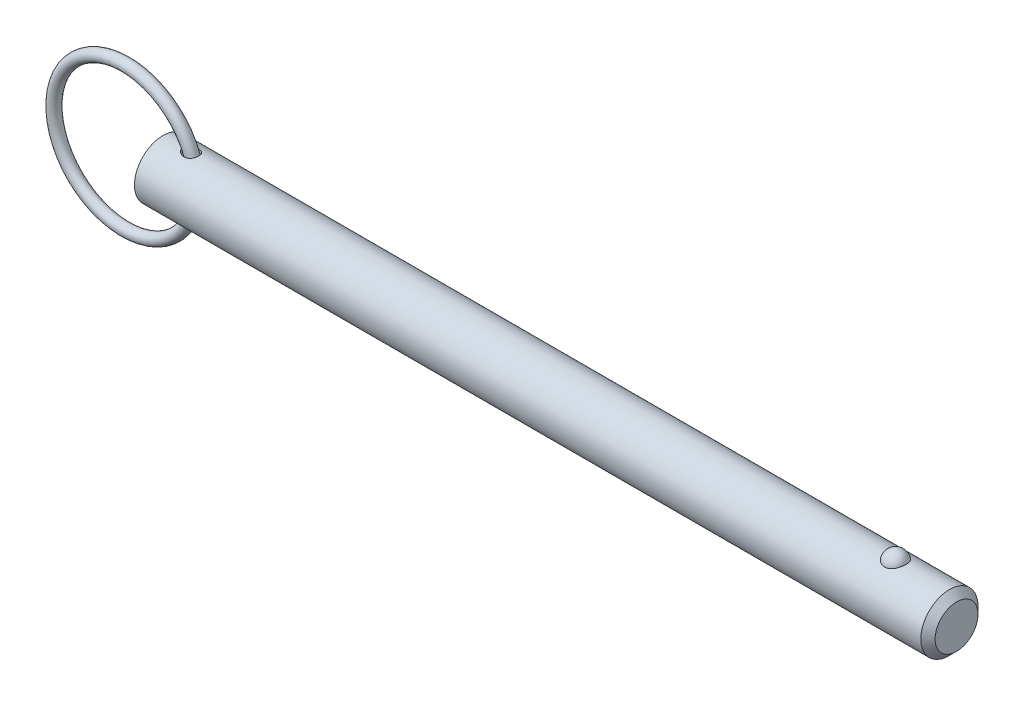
ISO-10303-21;
HEADER;
FILE_DESCRIPTION(('STEP AP214'),'2;1');
FILE_NAME('part.step','',(''),(''),'','','');
FILE_SCHEMA(('AUTOMOTIVE_DESIGN { 1 0 10303 214 1 1 1 1 }'));
ENDSEC;
DATA;
#1=APPLICATION_CONTEXT('core data for automotive mechanical design processes');
#2=APPLICATION_PROTOCOL_DEFINITION('international standard','automotive_design',2000,#1);
#3=PRODUCT_CONTEXT('',#1,'mechanical');
#4=PRODUCT('Part','Part','',(#3));
#5=PRODUCT_RELATED_PRODUCT_CATEGORY('part','',(#4));
#6=PRODUCT_DEFINITION_FORMATION('','',#4);
#7=PRODUCT_DEFINITION_CONTEXT('part definition',#1,'design');
#8=PRODUCT_DEFINITION('design','',#6,#7);
#9=PRODUCT_DEFINITION_SHAPE('','',#8);
#10=(LENGTH_UNIT() NAMED_UNIT(*) SI_UNIT(.MILLI.,.METRE.));
#11=(NAMED_UNIT(*) PLANE_ANGLE_UNIT() SI_UNIT($,.RADIAN.));
#12=(NAMED_UNIT(*) SI_UNIT($,.STERADIAN.) SOLID_ANGLE_UNIT());
#13=UNCERTAINTY_MEASURE_WITH_UNIT(LENGTH_MEASURE(1.E-05),#10,'distance_accuracy_value','');
#14=(GEOMETRIC_REPRESENTATION_CONTEXT(3) GLOBAL_UNCERTAINTY_ASSIGNED_CONTEXT((#13)) GLOBAL_UNIT_ASSIGNED_CONTEXT((#10,
#11,#12)) REPRESENTATION_CONTEXT('',''));
#15=CARTESIAN_POINT('',(0.,0.,0.));
#16=DIRECTION('',(0.,0.,1.));
#17=DIRECTION('',(1.,0.,0.));
#18=AXIS2_PLACEMENT_3D('',#15,#16,#17);
#19=CARTESIAN_POINT('',(-8.34703434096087,0.,0.));
#20=DIRECTION('',(0.,0.,1.));
#21=DIRECTION('',(1.,0.,0.));
#22=AXIS2_PLACEMENT_3D('',#19,#20,#21);
#23=TOROIDAL_SURFACE('',#22,15.875,1.27);
#24=CARTESIAN_POINT('',(8.79796565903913,0.,0.));
#25=VERTEX_POINT('',#24);
#26=VERTEX_LOOP('',#25);
#27=FACE_BOUND('',#26,.T.);
#28=ADVANCED_FACE('P0_F12',(#27),#23,.T.);
#29=CLOSED_SHELL('',(#28));
#30=MANIFOLD_SOLID_BREP('P0_B1',#29);
#31=CARTESIAN_POINT('',(0.,0.,0.));
#32=DIRECTION('',(1.,0.,0.));
#33=DIRECTION('',(0.,0.,-1.));
#34=AXIS2_PLACEMENT_3D('',#31,#32,#33);
#35=CYLINDRICAL_SURFACE('',#34,6.35);
#36=CARTESIAN_POINT('',(4.87230670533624,6.27273159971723,-0.987592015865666));
#37=CARTESIAN_POINT('',(4.94734735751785,6.26035058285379,-1.06623378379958));
#38=CARTESIAN_POINT('',(5.02968768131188,6.24755813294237,-1.13788608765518));
#39=CARTESIAN_POINT('',(5.20534267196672,6.22278258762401,-1.26640223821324));
#40=CARTESIAN_POINT('',(5.29867273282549,6.21080066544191,-1.32324497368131));
#41=CARTESIAN_POINT('',(5.49318962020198,6.18912414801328,-1.42117930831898));
#42=CARTESIAN_POINT('',(5.59435470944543,6.17942350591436,-1.46231273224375));
#43=CARTESIAN_POINT('',(5.80219659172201,6.16352555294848,-1.52793951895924));
#44=CARTESIAN_POINT('',(5.90887152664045,6.15732706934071,-1.55243845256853));
#45=CARTESIAN_POINT('',(6.12818220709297,6.14931784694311,-1.58387975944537));
#46=CARTESIAN_POINT('',(6.24090110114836,6.14763959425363,-1.59029227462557));
#47=CARTESIAN_POINT('',(6.46560233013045,6.14965588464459,-1.58248630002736));
#48=CARTESIAN_POINT('',(6.57758514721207,6.15334646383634,-1.56828303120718));
#49=CARTESIAN_POINT('',(6.78516594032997,6.1652116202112,-1.52091398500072));
#50=CARTESIAN_POINT('',(6.88126802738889,6.17288876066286,-1.48983713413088));
#51=CARTESIAN_POINT('',(7.06576629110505,6.19149190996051,-1.41052329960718));
#52=CARTESIAN_POINT('',(7.15416739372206,6.20241582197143,-1.36229738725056));
#53=CARTESIAN_POINT('',(7.3116692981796,6.2248616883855,-1.25548983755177));
#54=CARTESIAN_POINT('',(7.38181442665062,6.23621734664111,-1.19840625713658));
#55=CARTESIAN_POINT('',(7.51101296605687,6.259037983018,-1.07284763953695));
#56=CARTESIAN_POINT('',(7.5700684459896,6.2705029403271,-1.00437473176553));
#57=CARTESIAN_POINT('',(7.67374693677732,6.29184873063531,-0.860384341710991));
#58=CARTESIAN_POINT('',(7.71876694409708,6.30176816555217,-0.785157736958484));
#59=CARTESIAN_POINT('',(7.79574491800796,6.31935829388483,-0.628053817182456));
#60=CARTESIAN_POINT('',(7.82770308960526,6.32702902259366,-0.546176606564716));
#61=CARTESIAN_POINT('',(7.87788845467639,6.33930929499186,-0.377876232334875));
#62=CARTESIAN_POINT('',(7.8960810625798,6.34391112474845,-0.291442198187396));
#63=CARTESIAN_POINT('',(7.91820729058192,6.34953044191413,-0.116652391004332));
#64=CARTESIAN_POINT('',(7.92214044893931,6.35054781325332,-0.0282965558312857));
#65=CARTESIAN_POINT('',(7.91564686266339,6.34888556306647,0.14826357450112));
#66=CARTESIAN_POINT('',(7.9051533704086,6.34618875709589,0.236465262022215));
#67=CARTESIAN_POINT('',(7.86991530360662,6.33735741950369,0.409798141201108));
#68=CARTESIAN_POINT('',(7.84517062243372,6.33122286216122,0.494929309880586));
#69=CARTESIAN_POINT('',(7.78199851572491,6.31618517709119,0.659657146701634));
#70=CARTESIAN_POINT('',(7.74357645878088,6.30728313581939,0.739255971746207));
#71=CARTESIAN_POINT('',(7.65396632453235,6.28769050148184,0.890663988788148));
#72=CARTESIAN_POINT('',(7.60277911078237,6.27700002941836,0.962473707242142));
#73=CARTESIAN_POINT('',(7.48925881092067,6.2550822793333,1.09590260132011));
#74=CARTESIAN_POINT('',(7.42698604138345,6.24385813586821,1.15757361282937));
#75=CARTESIAN_POINT('',(7.29283556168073,6.2220655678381,1.26951234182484));
#76=CARTESIAN_POINT('',(7.22095880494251,6.21149707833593,1.31978118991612));
#77=CARTESIAN_POINT('',(7.06971853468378,6.19216002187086,1.40772509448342));
#78=CARTESIAN_POINT('',(6.99035873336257,6.18339056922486,1.44540635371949));
#79=CARTESIAN_POINT('',(6.826427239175,6.16851603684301,1.50762653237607));
#80=CARTESIAN_POINT('',(6.74185489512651,6.16241129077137,1.53216380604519));
#81=CARTESIAN_POINT('',(6.56686412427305,6.15321474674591,1.56869994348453));
#82=CARTESIAN_POINT('',(6.47634467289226,6.15023369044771,1.58023897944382));
#83=CARTESIAN_POINT('',(6.29456956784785,6.14778331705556,1.58974172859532));
#84=CARTESIAN_POINT('',(6.20331368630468,6.1483151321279,1.58770106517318));
#85=CARTESIAN_POINT('',(6.01385969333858,6.15284811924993,1.5700487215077));
#86=CARTESIAN_POINT('',(5.91578322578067,6.15715979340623,1.55322212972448));
#87=CARTESIAN_POINT('',(5.72331909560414,6.16902415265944,1.5054032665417));
#88=CARTESIAN_POINT('',(5.62893440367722,6.17657939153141,1.4743998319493));
#89=CARTESIAN_POINT('',(5.43572606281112,6.19502494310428,1.39499475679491));
#90=CARTESIAN_POINT('',(5.33755891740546,6.20619097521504,1.3450526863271));
#91=CARTESIAN_POINT('',(5.15090047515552,6.23006191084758,1.22975103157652));
#92=CARTESIAN_POINT('',(5.06240741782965,6.24276653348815,1.16439425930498));
#93=CARTESIAN_POINT('',(4.91171642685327,6.26607433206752,1.03083814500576));
#94=CARTESIAN_POINT('',(4.84758224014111,6.27668356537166,0.964825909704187));
#95=CARTESIAN_POINT('',(4.73090054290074,6.29683133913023,0.823112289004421));
#96=CARTESIAN_POINT('',(4.6783368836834,6.30637136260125,0.747424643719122));
#97=CARTESIAN_POINT('',(4.59543145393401,6.32183254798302,0.601150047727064));
#98=CARTESIAN_POINT('',(4.56283099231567,6.32809321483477,0.531883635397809));
#99=CARTESIAN_POINT('',(4.50941370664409,6.33849198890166,0.388778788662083));
#100=CARTESIAN_POINT('',(4.48858876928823,6.34263155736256,0.314943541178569));
#101=CARTESIAN_POINT('',(4.46008864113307,6.3483236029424,0.164282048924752));
#102=CARTESIAN_POINT('',(4.45247558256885,6.34986385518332,0.0874434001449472));
#103=CARTESIAN_POINT('',(4.45121096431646,6.35011863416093,-0.0663538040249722));
#104=CARTESIAN_POINT('',(4.45755802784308,6.34883343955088,-0.143312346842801));
#105=CARTESIAN_POINT('',(4.48267656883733,6.34380948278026,-0.288945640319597));
#106=CARTESIAN_POINT('',(4.50045680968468,6.34026665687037,-0.357802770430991));
#107=CARTESIAN_POINT('',(4.54636050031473,6.33128211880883,-0.49181574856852));
#108=CARTESIAN_POINT('',(4.57448566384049,6.32584009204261,-0.556970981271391));
#109=CARTESIAN_POINT('',(4.64209700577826,6.31308107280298,-0.687092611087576));
#110=CARTESIAN_POINT('',(4.68226903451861,6.30565525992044,-0.75168940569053));
#111=CARTESIAN_POINT('',(4.77120834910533,6.28979741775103,-0.874524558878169));
#112=CARTESIAN_POINT('',(4.81998302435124,6.28136452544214,-0.932757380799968));
#113=CARTESIAN_POINT('',(4.87230670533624,6.27273159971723,-0.987592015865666));
#114=B_SPLINE_CURVE_WITH_KNOTS('',3,(#36,#37,#38,#39,#40,#41,#42,#43,#44,#45,#46,#47,#48,#49,
#50,#51,#52,#53,#54,#55,#56,#57,#58,#59,#60,#61,#62,#63,#64,#65,#66,#67,#68,#69,#70,#71,#72,#73,
#74,#75,#76,#77,#78,#79,#80,#81,#82,#83,#84,#85,#86,#87,#88,#89,#90,#91,#92,#93,#94,#95,#96,#97,
#98,#99,#100,#101,#102,#103,#104,#105,#106,#107,#108,#109,#110,#111,#112,#113),.UNSPECIFIED.,
.T.,.F.,(4,2,2,2,2,2,2,2,2,2,2,2,2,2,2,2,2,2,2,2,2,2,2,2,2,2,2,2,2,2,2,2,2,2,2,2,2,2,4),(0.,
0.327902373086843,0.65626964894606,0.98375647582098,1.31113357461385,1.64800657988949,
1.98463099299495,2.28681225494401,2.58879878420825,2.86088594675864,3.13292229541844,
3.39636481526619,3.65980320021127,3.92390128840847,4.18800792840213,4.45334062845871,
4.7186753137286,4.98390596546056,5.24911867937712,5.51293017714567,5.7767155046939,
6.04037065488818,6.30405880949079,6.57680801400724,6.84964512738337,7.14724526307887,
7.44508014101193,7.77572668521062,8.10631295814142,8.38318772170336,8.65967357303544,
8.8891530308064,9.11847418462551,9.34887088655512,9.57924486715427,9.79193291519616,
10.0046562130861,10.2330958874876,10.4617327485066),.UNSPECIFIED.);
#115=CARTESIAN_POINT('',(4.87230670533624,6.27273159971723,-0.987592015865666));
#116=VERTEX_POINT('',#115);
#117=EDGE_CURVE('P1_E40',#116,#116,#114,.T.);
#118=ORIENTED_EDGE('',*,*,#117,.T.);
#119=EDGE_LOOP('',(#118));
#120=FACE_BOUND('',#119,.T.);
#121=CARTESIAN_POINT('',(174.6125,0.,0.));
#122=DIRECTION('',(1.,0.,0.));
#123=DIRECTION('',(0.,0.,-1.));
#124=AXIS2_PLACEMENT_3D('',#121,#122,#123);
#125=CIRCLE('',#124,6.35);
#126=CARTESIAN_POINT('',(174.6125,0.,-6.35));
#127=VERTEX_POINT('',#126);
#128=EDGE_CURVE('P1_E25',#127,#127,#125,.T.);
#129=ORIENTED_EDGE('',*,*,#128,.F.);
#130=EDGE_LOOP('',(#129));
#131=FACE_BOUND('',#130,.T.);
#132=CARTESIAN_POINT('',(0.,0.,0.));
#133=DIRECTION('',(1.,0.,0.));
#134=DIRECTION('',(0.,0.,-1.));
#135=AXIS2_PLACEMENT_3D('',#132,#133,#134);
#136=CIRCLE('',#135,6.35);
#137=CARTESIAN_POINT('',(0.,0.,-6.35));
#138=VERTEX_POINT('',#137);
#139=EDGE_CURVE('P1_E9',#138,#138,#136,.T.);
#140=ORIENTED_EDGE('',*,*,#139,.T.);
#141=EDGE_LOOP('',(#140));
#142=FACE_BOUND('',#141,.T.);
#143=CARTESIAN_POINT('',(162.650021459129,5.87502187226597,2.40969251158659));
#144=CARTESIAN_POINT('',(162.525030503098,5.87501645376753,2.40969773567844));
#145=CARTESIAN_POINT('',(162.400080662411,5.87916061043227,2.39967292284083));
#146=CARTESIAN_POINT('',(162.153909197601,5.8952311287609,2.35991730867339));
#147=CARTESIAN_POINT('',(162.032686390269,5.90715499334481,2.33019283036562));
#148=CARTESIAN_POINT('',(161.797517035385,5.93739567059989,2.25201402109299));
#149=CARTESIAN_POINT('',(161.683560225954,5.95570321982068,2.20358681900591));
#150=CARTESIAN_POINT('',(161.46557352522,5.99672067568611,2.08937987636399));
#151=CARTESIAN_POINT('',(161.361545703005,6.01943149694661,2.02359652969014));
#152=CARTESIAN_POINT('',(161.162943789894,6.06760647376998,1.87428969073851));
#153=CARTESIAN_POINT('',(161.068726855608,6.09313095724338,1.79031110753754));
#154=CARTESIAN_POINT('',(160.895255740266,6.14375873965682,1.60800178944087));
#155=CARTESIAN_POINT('',(160.816004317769,6.16886196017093,1.50966841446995));
#156=CARTESIAN_POINT('',(160.670845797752,6.21724600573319,1.29645884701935));
#157=CARTESIAN_POINT('',(160.605688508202,6.24039621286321,1.18104158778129));
#158=CARTESIAN_POINT('',(160.494703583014,6.28117277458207,0.940351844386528));
#159=CARTESIAN_POINT('',(160.448877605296,6.29879865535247,0.815078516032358));
#160=CARTESIAN_POINT('',(160.377023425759,6.32692073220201,0.55649439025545));
#161=CARTESIAN_POINT('',(160.351249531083,6.33732517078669,0.42310277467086));
#162=CARTESIAN_POINT('',(160.320988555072,6.34957673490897,0.153542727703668));
#163=CARTESIAN_POINT('',(160.316500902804,6.35142408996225,0.0173743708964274));
#164=CARTESIAN_POINT('',(160.328865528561,6.34638925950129,-0.253036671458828));
#165=CARTESIAN_POINT('',(160.345594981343,6.33955731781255,-0.387285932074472));
#166=CARTESIAN_POINT('',(160.399843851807,6.31794129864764,-0.650851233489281));
#167=CARTESIAN_POINT('',(160.437363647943,6.30315707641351,-0.7801671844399));
#168=CARTESIAN_POINT('',(160.532500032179,6.26711642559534,-1.03041949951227));
#169=CARTESIAN_POINT('',(160.590143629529,6.24585130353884,-1.1513443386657));
#170=CARTESIAN_POINT('',(160.724352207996,6.19905619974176,-1.38129800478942));
#171=CARTESIAN_POINT('',(160.800918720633,6.17352587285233,-1.49032586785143));
#172=CARTESIAN_POINT('',(160.971753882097,6.12080227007,-1.69393164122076));
#173=CARTESIAN_POINT('',(161.066100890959,6.09360200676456,-1.78844209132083));
#174=CARTESIAN_POINT('',(161.270119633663,6.04070434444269,-1.95970536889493));
#175=CARTESIAN_POINT('',(161.379790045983,6.01500681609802,-2.03645972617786));
#176=CARTESIAN_POINT('',(161.609187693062,5.96867714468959,-2.1684564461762));
#177=CARTESIAN_POINT('',(161.728652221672,5.94794910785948,-2.2241206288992));
#178=CARTESIAN_POINT('',(161.976218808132,5.91340580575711,-2.31440992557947));
#179=CARTESIAN_POINT('',(162.104317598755,5.8995879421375,-2.3490429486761));
#180=CARTESIAN_POINT('',(162.358582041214,5.88111049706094,-2.39491590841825));
#181=CARTESIAN_POINT('',(162.484520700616,5.876025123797,-2.40724512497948));
#182=CARTESIAN_POINT('',(162.736786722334,5.87428980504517,-2.41147867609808));
#183=CARTESIAN_POINT('',(162.863114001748,5.87763817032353,-2.40338710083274));
#184=CARTESIAN_POINT('',(163.108417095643,5.89212921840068,-2.36762715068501));
#185=CARTESIAN_POINT('',(163.227499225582,5.90302431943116,-2.34058030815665));
#186=CARTESIAN_POINT('',(163.45924472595,5.93113752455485,-2.26839066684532));
#187=CARTESIAN_POINT('',(163.571907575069,5.94835614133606,-2.22324640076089));
#188=CARTESIAN_POINT('',(163.790400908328,5.98773016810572,-2.11493806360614));
#189=CARTESIAN_POINT('',(163.896028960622,6.00998499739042,-2.05140269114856));
#190=CARTESIAN_POINT('',(164.095300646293,6.05690144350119,-1.90842705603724));
#191=CARTESIAN_POINT('',(164.188941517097,6.08156361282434,-1.82898313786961));
#192=CARTESIAN_POINT('',(164.366675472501,6.13211715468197,-1.65182429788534));
#193=CARTESIAN_POINT('',(164.450055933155,6.15800825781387,-1.55339381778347));
#194=CARTESIAN_POINT('',(164.599790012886,6.20712834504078,-1.34374214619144));
#195=CARTESIAN_POINT('',(164.666140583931,6.23035685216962,-1.23251867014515));
#196=CARTESIAN_POINT('',(164.782345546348,6.27251177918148,-0.996447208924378));
#197=CARTESIAN_POINT('',(164.831607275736,6.29127762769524,-0.871278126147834));
#198=CARTESIAN_POINT('',(164.909614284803,6.3215862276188,-0.613870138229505));
#199=CARTESIAN_POINT('',(164.938359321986,6.33312889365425,-0.481631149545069));
#200=CARTESIAN_POINT('',(164.97477058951,6.34782349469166,-0.213672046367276));
#201=CARTESIAN_POINT('',(164.982413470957,6.35096613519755,-0.0779482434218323));
#202=CARTESIAN_POINT('',(164.976395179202,6.34851322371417,0.192943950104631));
#203=CARTESIAN_POINT('',(164.962734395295,6.3429178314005,0.328112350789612));
#204=CARTESIAN_POINT('',(164.91450361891,6.32360512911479,0.593406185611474));
#205=CARTESIAN_POINT('',(164.880031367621,6.30992579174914,0.723552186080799));
#206=CARTESIAN_POINT('',(164.790953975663,6.27586325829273,0.975834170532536));
#207=CARTESIAN_POINT('',(164.73634761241,6.25547965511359,1.09796966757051));
#208=CARTESIAN_POINT('',(164.60775879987,6.20998183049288,1.33148921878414));
#209=CARTESIAN_POINT('',(164.533674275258,6.18484288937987,1.44281227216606));
#210=CARTESIAN_POINT('',(164.367820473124,6.13258735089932,1.65087683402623));
#211=CARTESIAN_POINT('',(164.276051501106,6.10547078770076,1.74761859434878));
#212=CARTESIAN_POINT('',(164.077183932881,6.05235879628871,1.92350926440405));
#213=CARTESIAN_POINT('',(163.970133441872,6.02636017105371,2.00271146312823));
#214=CARTESIAN_POINT('',(163.743138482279,5.97843747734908,2.1415415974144));
#215=CARTESIAN_POINT('',(163.623191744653,5.95651412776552,2.20116608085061));
#216=CARTESIAN_POINT('',(163.364523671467,5.91812106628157,2.30250570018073));
#217=CARTESIAN_POINT('',(163.22506980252,5.90217533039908,2.34256795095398));
#218=CARTESIAN_POINT('',(162.940397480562,5.88063128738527,2.39615214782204));
#219=CARTESIAN_POINT('',(162.79518174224,5.8750281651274,2.40968644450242));
#220=CARTESIAN_POINT('',(162.650021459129,5.87502187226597,2.40969251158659));
#221=B_SPLINE_CURVE_WITH_KNOTS('',3,(#143,#144,#145,#146,#147,#148,#149,#150,#151,#152,#153,
#154,#155,#156,#157,#158,#159,#160,#161,#162,#163,#164,#165,#166,#167,#168,#169,#170,#171,#172,
#173,#174,#175,#176,#177,#178,#179,#180,#181,#182,#183,#184,#185,#186,#187,#188,#189,#190,#191,
#192,#193,#194,#195,#196,#197,#198,#199,#200,#201,#202,#203,#204,#205,#206,#207,#208,#209,#210,
#211,#212,#213,#214,#215,#216,#217,#218,#219,#220),.UNSPECIFIED.,.T.,.F.,(4,2,2,2,2,2,2,2,2,2,2,
2,2,2,2,2,2,2,2,2,2,2,2,2,2,2,2,2,2,2,2,2,2,2,2,2,2,2,4),(0.,0.374440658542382,
0.748761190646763,1.12254078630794,1.49639810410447,1.88098871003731,2.2656501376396,
2.6674110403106,3.06920639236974,3.47601794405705,3.88281858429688,4.28727498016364,
4.69173873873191,5.09674745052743,5.50178895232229,5.9086591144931,6.31549420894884,
6.71369855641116,7.11175305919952,7.48978077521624,7.86773278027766,8.2338388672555,
8.59997464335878,8.97409044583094,9.34829231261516,9.74122667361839,10.1342313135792,
10.5397522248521,10.9452779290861,11.3512521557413,11.7572189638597,12.1612938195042,
12.5653932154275,12.9716540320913,13.3779078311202,13.7829098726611,14.1879832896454,
14.6230486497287,15.0579114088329),.UNSPECIFIED.);
#222=CARTESIAN_POINT('',(162.650021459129,5.87502187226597,2.40969251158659));
#223=VERTEX_POINT('',#222);
#224=EDGE_CURVE('P1_E34',#223,#223,#221,.T.);
#225=ORIENTED_EDGE('',*,*,#224,.T.);
#226=EDGE_LOOP('',(#225));
#227=FACE_BOUND('',#226,.T.);
#228=CARTESIAN_POINT('',(4.87230670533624,-6.27273159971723,-0.987592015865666));
#229=CARTESIAN_POINT('',(4.81440819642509,-6.28228431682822,-0.926913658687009));
#230=CARTESIAN_POINT('',(4.76085022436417,-6.29159289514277,-0.862071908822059));
#231=CARTESIAN_POINT('',(4.66448472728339,-6.3088950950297,-0.724655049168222));
#232=CARTESIAN_POINT('',(4.62166818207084,-6.31688981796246,-0.652086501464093));
#233=CARTESIAN_POINT('',(4.54882773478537,-6.33076917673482,-0.499747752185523));
#234=CARTESIAN_POINT('',(4.51891553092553,-6.33663532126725,-0.419921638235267));
#235=CARTESIAN_POINT('',(4.4747692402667,-6.3453711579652,-0.255882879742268));
#236=CARTESIAN_POINT('',(4.4605188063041,-6.34824397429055,-0.171674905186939));
#237=CARTESIAN_POINT('',(4.44966179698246,-6.35043041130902,-0.012076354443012));
#238=CARTESIAN_POINT('',(4.45117530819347,-6.35012328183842,0.063184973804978));
#239=CARTESIAN_POINT('',(4.46726452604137,-6.34689000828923,0.212230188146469));
#240=CARTESIAN_POINT('',(4.48184026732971,-6.3439638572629,0.286014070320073));
#241=CARTESIAN_POINT('',(4.52202068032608,-6.33603071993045,0.426550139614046));
#242=CARTESIAN_POINT('',(4.54707079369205,-6.33112875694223,0.493469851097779));
#243=CARTESIAN_POINT('',(4.60669855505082,-6.31972370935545,0.622743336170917));
#244=CARTESIAN_POINT('',(4.64127887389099,-6.31322017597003,0.685095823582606));
#245=CARTESIAN_POINT('',(4.7232814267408,-6.29826068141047,0.811769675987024));
#246=CARTESIAN_POINT('',(4.77176118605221,-6.28966287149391,0.87538636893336));
#247=CARTESIAN_POINT('',(4.87703902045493,-6.27182325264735,0.995192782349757));
#248=CARTESIAN_POINT('',(4.93384225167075,-6.26258104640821,1.05137785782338));
#249=CARTESIAN_POINT('',(5.06617436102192,-6.24228878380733,1.16635591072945));
#250=CARTESIAN_POINT('',(5.14318167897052,-6.23124423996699,1.22345054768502));
#251=CARTESIAN_POINT('',(5.3047576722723,-6.21023402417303,1.32598441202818));
#252=CARTESIAN_POINT('',(5.38933237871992,-6.20026922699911,1.37141422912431));
#253=CARTESIAN_POINT('',(5.57760134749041,-6.18099350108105,1.45601817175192));
#254=CARTESIAN_POINT('',(5.68224348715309,-6.17201456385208,1.4931788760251));
#255=CARTESIAN_POINT('',(5.89649087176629,-6.15800474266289,1.5499484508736));
#256=CARTESIAN_POINT('',(6.00609708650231,-6.15297463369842,1.56955387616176));
#257=CARTESIAN_POINT('',(6.22752772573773,-6.14779725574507,1.58971993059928));
#258=CARTESIAN_POINT('',(6.33935715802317,-6.14766266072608,1.59023112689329));
#259=CARTESIAN_POINT('',(6.56108231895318,-6.15269227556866,1.57066564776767));
#260=CARTESIAN_POINT('',(6.67097982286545,-6.15785133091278,1.55060899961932));
#261=CARTESIAN_POINT('',(6.87257705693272,-6.17211580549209,1.4927326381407));
#262=CARTESIAN_POINT('',(6.96494608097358,-6.18072242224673,1.45711948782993));
#263=CARTESIAN_POINT('',(7.14129343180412,-6.20069920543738,1.36960980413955));
#264=CARTESIAN_POINT('',(7.22527609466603,-6.21206793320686,1.31772174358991));
#265=CARTESIAN_POINT('',(7.37471505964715,-6.23497047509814,1.20443359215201));
#266=CARTESIAN_POINT('',(7.44115811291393,-6.24639757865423,1.14430788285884));
#267=CARTESIAN_POINT('',(7.56261868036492,-6.26896339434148,1.0134084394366));
#268=CARTESIAN_POINT('',(7.61763801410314,-6.28010215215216,0.942636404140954));
#269=CARTESIAN_POINT('',(7.71360563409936,-6.30055923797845,0.794304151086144));
#270=CARTESIAN_POINT('',(7.75485562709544,-6.3099143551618,0.716943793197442));
#271=CARTESIAN_POINT('',(7.82406051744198,-6.32610528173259,0.556244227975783));
#272=CARTESIAN_POINT('',(7.85201540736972,-6.33294108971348,0.472905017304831));
#273=CARTESIAN_POINT('',(7.89408663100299,-6.34338077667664,0.302249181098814));
#274=CARTESIAN_POINT('',(7.90814615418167,-6.34697138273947,0.214917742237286));
#275=CARTESIAN_POINT('',(7.92192329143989,-6.35048887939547,0.0390564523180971));
#276=CARTESIAN_POINT('',(7.92164046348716,-6.3504156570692,-0.0494734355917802));
#277=CARTESIAN_POINT('',(7.9067075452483,-6.34660520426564,-0.225592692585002));
#278=CARTESIAN_POINT('',(7.89199989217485,-6.34285329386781,-0.313176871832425));
#279=CARTESIAN_POINT('',(7.84845340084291,-6.33206809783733,-0.484549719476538));
#280=CARTESIAN_POINT('',(7.8196145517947,-6.32503480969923,-0.568338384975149));
#281=CARTESIAN_POINT('',(7.74850591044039,-6.30846389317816,-0.729625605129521));
#282=CARTESIAN_POINT('',(7.70625193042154,-6.29892921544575,-0.807131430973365));
#283=CARTESIAN_POINT('',(7.60933437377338,-6.27840608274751,-0.953731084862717));
#284=CARTESIAN_POINT('',(7.55467181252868,-6.2674177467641,-1.02282560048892));
#285=CARTESIAN_POINT('',(7.43471786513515,-6.24527869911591,-1.15028913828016));
#286=CARTESIAN_POINT('',(7.36948829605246,-6.23412925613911,-1.20871657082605));
#287=CARTESIAN_POINT('',(7.23001723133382,-6.21283678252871,-1.3137894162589));
#288=CARTESIAN_POINT('',(7.15577649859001,-6.20269366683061,-1.36043582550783));
#289=CARTESIAN_POINT('',(7.00025986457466,-6.18446636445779,-1.44103993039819));
#290=CARTESIAN_POINT('',(6.91896776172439,-6.17638709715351,-1.47496739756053));
#291=CARTESIAN_POINT('',(6.75184232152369,-6.16309237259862,-1.52957024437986));
#292=CARTESIAN_POINT('',(6.6660081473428,-6.15787744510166,-1.55024317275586));
#293=CARTESIAN_POINT('',(6.48842585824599,-6.15055064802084,-1.57906962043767));
#294=CARTESIAN_POINT('',(6.39658108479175,-6.14857915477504,-1.58665744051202));
#295=CARTESIAN_POINT('',(6.21279832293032,-6.14817707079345,-1.58821048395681));
#296=CARTESIAN_POINT('',(6.12086031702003,-6.14974736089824,-1.58217231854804));
#297=CARTESIAN_POINT('',(5.92996902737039,-6.15640095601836,-1.55609403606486));
#298=CARTESIAN_POINT('',(5.83120653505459,-6.16181208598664,-1.53474519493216));
#299=CARTESIAN_POINT('',(5.63804881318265,-6.17573474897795,-1.47771859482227));
#300=CARTESIAN_POINT('',(5.54365953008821,-6.18425037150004,-1.44202192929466));
#301=CARTESIAN_POINT('',(5.34413923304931,-6.20522938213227,-1.34918979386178));
#302=CARTESIAN_POINT('',(5.24033140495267,-6.21813417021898,-1.28928337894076));
#303=CARTESIAN_POINT('',(5.0455423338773,-6.24510162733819,-1.15156760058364));
#304=CARTESIAN_POINT('',(4.95454590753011,-6.25916289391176,-1.07377972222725));
#305=CARTESIAN_POINT('',(4.87230670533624,-6.27273159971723,-0.987592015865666));
#306=B_SPLINE_CURVE_WITH_KNOTS('',3,(#228,#229,#230,#231,#232,#233,#234,#235,#236,#237,#238,
#239,#240,#241,#242,#243,#244,#245,#246,#247,#248,#249,#250,#251,#252,#253,#254,#255,#256,#257,
#258,#259,#260,#261,#262,#263,#264,#265,#266,#267,#268,#269,#270,#271,#272,#273,#274,#275,#276,
#277,#278,#279,#280,#281,#282,#283,#284,#285,#286,#287,#288,#289,#290,#291,#292,#293,#294,#295,
#296,#297,#298,#299,#300,#301,#302,#303,#304,#305),.UNSPECIFIED.,.T.,.F.,(4,2,2,2,2,2,2,2,2,2,2,
2,2,2,2,2,2,2,2,2,2,2,2,2,2,2,2,2,2,2,2,2,2,2,2,2,2,2,4),(0.,0.252951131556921,0.50568912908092,
0.760572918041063,1.01519041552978,1.23982791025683,1.46446600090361,1.67847364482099,
1.89254132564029,2.13299551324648,2.37359928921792,2.6619896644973,2.95061196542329,
3.28329078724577,3.61603488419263,3.94964035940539,4.282921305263,4.57939201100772,
4.87570862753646,5.14538810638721,5.4150245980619,5.67829123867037,5.94155802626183,
6.20589676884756,6.47024365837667,6.73564974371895,7.00105603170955,7.26615064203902,
7.53122356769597,7.79479837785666,8.05835088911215,8.32252586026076,8.58674967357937,
8.86213419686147,9.137587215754,9.43991696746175,9.74264642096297,10.1023688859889,
10.461661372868),.UNSPECIFIED.);
#307=CARTESIAN_POINT('',(4.87230670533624,-6.27273159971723,-0.987592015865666));
#308=VERTEX_POINT('',#307);
#309=EDGE_CURVE('P1_E17',#308,#308,#306,.T.);
#310=ORIENTED_EDGE('',*,*,#309,.T.);
#311=EDGE_LOOP('',(#310));
#312=FACE_BOUND('',#311,.T.);
#313=ADVANCED_FACE('P1_F13',(#120,#131,#142,#227,#312),#35,.T.);
#314=CARTESIAN_POINT('',(0.,0.,0.));
#315=DIRECTION('',(-1.,0.,0.));
#316=DIRECTION('',(0.,0.,1.));
#317=AXIS2_PLACEMENT_3D('',#314,#315,#316);
#318=PLANE('',#317);
#319=ORIENTED_EDGE('',*,*,#139,.F.);
#320=EDGE_LOOP('',(#319));
#321=FACE_BOUND('',#320,.T.);
#322=ADVANCED_FACE('P1_F15',(#321),#318,.T.);
#323=CARTESIAN_POINT('',(176.2,0.,0.));
#324=DIRECTION('',(-1.,0.,0.));
#325=DIRECTION('',(0.,0.,1.));
#326=AXIS2_PLACEMENT_3D('',#323,#324,#325);
#327=CONICAL_SURFACE('',#326,4.76250000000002,0.785398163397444);
#328=ORIENTED_EDGE('',*,*,#128,.T.);
#329=EDGE_LOOP('',(#328));
#330=FACE_BOUND('',#329,.T.);
#331=CARTESIAN_POINT('',(176.2,0.,0.));
#332=DIRECTION('',(1.,0.,0.));
#333=DIRECTION('',(0.,0.,-1.));
#334=AXIS2_PLACEMENT_3D('',#331,#332,#333);
#335=CIRCLE('',#334,4.76250000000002);
#336=CARTESIAN_POINT('',(176.2,0.,-4.76250000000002));
#337=VERTEX_POINT('',#336);
#338=EDGE_CURVE('P1_E30',#337,#337,#335,.T.);
#339=ORIENTED_EDGE('',*,*,#338,.F.);
#340=EDGE_LOOP('',(#339));
#341=FACE_BOUND('',#340,.T.);
#342=ADVANCED_FACE('P1_F55',(#330,#341),#327,.T.);
#343=CARTESIAN_POINT('',(176.2,4.76250000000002,0.));
#344=DIRECTION('',(1.,0.,0.));
#345=DIRECTION('',(0.,0.,-1.));
#346=AXIS2_PLACEMENT_3D('',#343,#344,#345);
#347=PLANE('',#346);
#348=ORIENTED_EDGE('',*,*,#338,.T.);
#349=EDGE_LOOP('',(#348));
#350=FACE_BOUND('',#349,.T.);
#351=ADVANCED_FACE('P1_F51',(#350),#347,.T.);
#352=CARTESIAN_POINT('',(162.650021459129,5.715,0.));
#353=DIRECTION('',(-1.,0.,0.));
#354=DIRECTION('',(0.,1.,0.));
#355=AXIS2_PLACEMENT_3D('',#352,#353,#354);
#356=SPHERICAL_SURFACE('',#355,2.415);
#357=ORIENTED_EDGE('',*,*,#224,.F.);
#358=EDGE_LOOP('',(#357));
#359=FACE_BOUND('',#358,.T.);
#360=ADVANCED_FACE('P1_F46',(#359),#356,.T.);
#361=CARTESIAN_POINT('',(-8.34703434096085,0.,0.));
#362=DIRECTION('',(0.,0.,1.));
#363=DIRECTION('',(1.,0.,0.));
#364=AXIS2_PLACEMENT_3D('',#361,#362,#363);
#365=TOROIDAL_SURFACE('',#364,15.875,1.5875);
#366=ORIENTED_EDGE('',*,*,#309,.F.);
#367=EDGE_LOOP('',(#366));
#368=FACE_BOUND('',#367,.T.);
#369=ORIENTED_EDGE('',*,*,#117,.F.);
#370=EDGE_LOOP('',(#369));
#371=FACE_BOUND('',#370,.T.);
#372=ADVANCED_FACE('P1_F50',(#368,#371),#365,.F.);
#373=CLOSED_SHELL('',(#313,#322,#342,#351,#360,#372));
#374=MANIFOLD_SOLID_BREP('P1_B1',#373);
#375=ADVANCED_BREP_SHAPE_REPRESENTATION('',(#18,#30,#374),#14);
#376=SHAPE_DEFINITION_REPRESENTATION(#9,#375);
ENDSEC;
END-ISO-10303-21;
